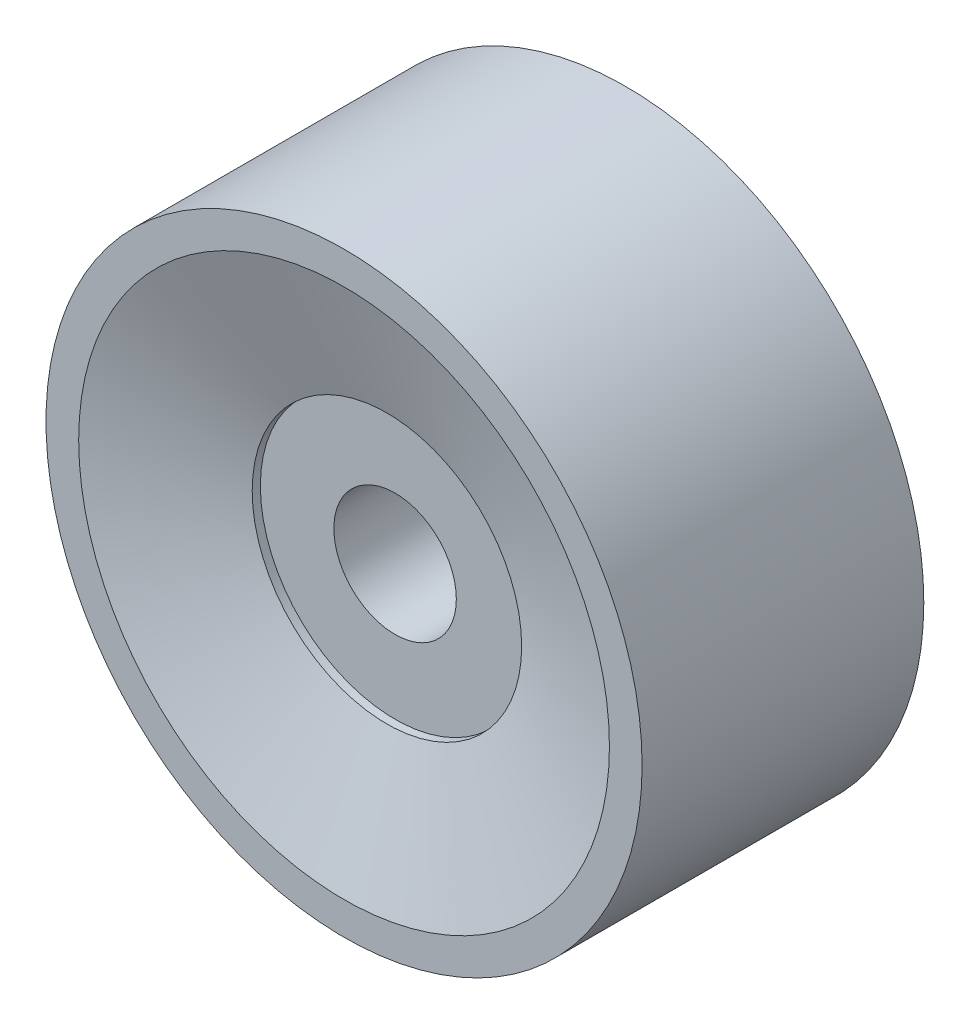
ISO-10303-21;
HEADER;
FILE_DESCRIPTION(('STEP AP214'),'2;1');
FILE_NAME('part.step','',(''),(''),'','','');
FILE_SCHEMA(('AUTOMOTIVE_DESIGN { 1 0 10303 214 1 1 1 1 }'));
ENDSEC;
DATA;
#1=APPLICATION_CONTEXT('core data for automotive mechanical design processes');
#2=APPLICATION_PROTOCOL_DEFINITION('international standard','automotive_design',2000,#1);
#3=PRODUCT_CONTEXT('',#1,'mechanical');
#4=PRODUCT('Part','Part','',(#3));
#5=PRODUCT_RELATED_PRODUCT_CATEGORY('part','',(#4));
#6=PRODUCT_DEFINITION_FORMATION('','',#4);
#7=PRODUCT_DEFINITION_CONTEXT('part definition',#1,'design');
#8=PRODUCT_DEFINITION('design','',#6,#7);
#9=PRODUCT_DEFINITION_SHAPE('','',#8);
#10=(LENGTH_UNIT() NAMED_UNIT(*) SI_UNIT(.MILLI.,.METRE.));
#11=(NAMED_UNIT(*) PLANE_ANGLE_UNIT() SI_UNIT($,.RADIAN.));
#12=(NAMED_UNIT(*) SI_UNIT($,.STERADIAN.) SOLID_ANGLE_UNIT());
#13=UNCERTAINTY_MEASURE_WITH_UNIT(LENGTH_MEASURE(1.E-05),#10,'distance_accuracy_value','');
#14=(GEOMETRIC_REPRESENTATION_CONTEXT(3) GLOBAL_UNCERTAINTY_ASSIGNED_CONTEXT((#13)) GLOBAL_UNIT_ASSIGNED_CONTEXT((#10,
#11,#12)) REPRESENTATION_CONTEXT('',''));
#15=CARTESIAN_POINT('',(0.,0.,0.));
#16=DIRECTION('',(0.,0.,1.));
#17=DIRECTION('',(1.,0.,0.));
#18=AXIS2_PLACEMENT_3D('',#15,#16,#17);
#19=CARTESIAN_POINT('',(0.,-42.5,17.25));
#20=DIRECTION('',(0.,0.,1.));
#21=DIRECTION('',(-1.,0.,0.));
#22=AXIS2_PLACEMENT_3D('',#19,#20,#21);
#23=PLANE('',#22);
#24=CARTESIAN_POINT('',(0.,0.,17.25));
#25=DIRECTION('',(0.,0.,-1.));
#26=DIRECTION('',(1.,0.,0.));
#27=AXIS2_PLACEMENT_3D('',#24,#25,#26);
#28=CIRCLE('',#27,32.5);
#29=CARTESIAN_POINT('',(32.5,0.,17.25));
#30=VERTEX_POINT('',#29);
#31=EDGE_CURVE('E32',#30,#30,#28,.T.);
#32=ORIENTED_EDGE('',*,*,#31,.T.);
#33=EDGE_LOOP('',(#32));
#34=FACE_BOUND('',#33,.T.);
#35=CARTESIAN_POINT('',(0.,0.,17.25));
#36=DIRECTION('',(0.,0.,1.));
#37=DIRECTION('',(1.,0.,0.));
#38=AXIS2_PLACEMENT_3D('',#35,#36,#37);
#39=CIRCLE('',#38,36.5);
#40=CARTESIAN_POINT('',(36.5,0.,17.25));
#41=VERTEX_POINT('',#40);
#42=EDGE_CURVE('E45',#41,#41,#39,.T.);
#43=ORIENTED_EDGE('',*,*,#42,.T.);
#44=EDGE_LOOP('',(#43));
#45=FACE_BOUND('',#44,.T.);
#46=ADVANCED_FACE('F12',(#34,#45),#23,.T.);
#47=CARTESIAN_POINT('',(0.,-42.5,-17.25));
#48=DIRECTION('',(0.,0.,1.));
#49=DIRECTION('',(-1.,0.,0.));
#50=AXIS2_PLACEMENT_3D('',#47,#48,#49);
#51=PLANE('',#50);
#52=CARTESIAN_POINT('',(0.,0.,-17.25));
#53=DIRECTION('',(0.,0.,-1.));
#54=DIRECTION('',(1.,0.,0.));
#55=AXIS2_PLACEMENT_3D('',#52,#53,#54);
#56=CIRCLE('',#55,32.5);
#57=CARTESIAN_POINT('',(32.5,0.,-17.25));
#58=VERTEX_POINT('',#57);
#59=EDGE_CURVE('E35',#58,#58,#56,.T.);
#60=ORIENTED_EDGE('',*,*,#59,.F.);
#61=EDGE_LOOP('',(#60));
#62=FACE_BOUND('',#61,.T.);
#63=CARTESIAN_POINT('',(0.,0.,-17.25));
#64=DIRECTION('',(0.,0.,1.));
#65=DIRECTION('',(1.,0.,0.));
#66=AXIS2_PLACEMENT_3D('',#63,#64,#65);
#67=CIRCLE('',#66,36.5);
#68=CARTESIAN_POINT('',(36.5,0.,-17.25));
#69=VERTEX_POINT('',#68);
#70=EDGE_CURVE('E44',#69,#69,#67,.T.);
#71=ORIENTED_EDGE('',*,*,#70,.F.);
#72=EDGE_LOOP('',(#71));
#73=FACE_BOUND('',#72,.T.);
#74=ADVANCED_FACE('F54',(#62,#73),#51,.F.);
#75=CARTESIAN_POINT('',(0.,-7.5,-11.));
#76=DIRECTION('',(0.,0.,-1.));
#77=DIRECTION('',(1.,0.,0.));
#78=AXIS2_PLACEMENT_3D('',#75,#76,#77);
#79=PLANE('',#78);
#80=CARTESIAN_POINT('',(0.,0.,-11.));
#81=DIRECTION('',(0.,0.,-1.));
#82=DIRECTION('',(1.,0.,0.));
#83=AXIS2_PLACEMENT_3D('',#80,#81,#82);
#84=CIRCLE('',#83,16.5);
#85=CARTESIAN_POINT('',(16.5,0.,-11.));
#86=VERTEX_POINT('',#85);
#87=EDGE_CURVE('E41',#86,#86,#84,.T.);
#88=ORIENTED_EDGE('',*,*,#87,.T.);
#89=EDGE_LOOP('',(#88));
#90=FACE_BOUND('',#89,.T.);
#91=CARTESIAN_POINT('',(0.,0.,-11.));
#92=DIRECTION('',(0.,0.,-1.));
#93=DIRECTION('',(1.,0.,0.));
#94=AXIS2_PLACEMENT_3D('',#91,#92,#93);
#95=CIRCLE('',#94,7.5);
#96=CARTESIAN_POINT('',(7.5,0.,-11.));
#97=VERTEX_POINT('',#96);
#98=EDGE_CURVE('E8',#97,#97,#95,.T.);
#99=ORIENTED_EDGE('',*,*,#98,.F.);
#100=EDGE_LOOP('',(#99));
#101=FACE_BOUND('',#100,.T.);
#102=ADVANCED_FACE('F14',(#90,#101),#79,.T.);
#103=CARTESIAN_POINT('',(0.,0.,-20.));
#104=DIRECTION('',(0.,0.,-1.));
#105=DIRECTION('',(1.,0.,0.));
#106=AXIS2_PLACEMENT_3D('',#103,#104,#105);
#107=CYLINDRICAL_SURFACE('',#106,7.5);
#108=ORIENTED_EDGE('',*,*,#98,.T.);
#109=EDGE_LOOP('',(#108));
#110=FACE_BOUND('',#109,.T.);
#111=CARTESIAN_POINT('',(0.,0.,11.));
#112=DIRECTION('',(0.,0.,-1.));
#113=DIRECTION('',(1.,0.,0.));
#114=AXIS2_PLACEMENT_3D('',#111,#112,#113);
#115=CIRCLE('',#114,7.5);
#116=CARTESIAN_POINT('',(7.5,0.,11.));
#117=VERTEX_POINT('',#116);
#118=EDGE_CURVE('E19',#117,#117,#115,.T.);
#119=ORIENTED_EDGE('',*,*,#118,.F.);
#120=EDGE_LOOP('',(#119));
#121=FACE_BOUND('',#120,.T.);
#122=ADVANCED_FACE('F64',(#110,#121),#107,.F.);
#123=CARTESIAN_POINT('',(0.,-7.5,11.));
#124=DIRECTION('',(0.,0.,-1.));
#125=DIRECTION('',(1.,0.,0.));
#126=AXIS2_PLACEMENT_3D('',#123,#124,#125);
#127=PLANE('',#126);
#128=CARTESIAN_POINT('',(0.,0.,11.));
#129=DIRECTION('',(0.,0.,-1.));
#130=DIRECTION('',(1.,0.,0.));
#131=AXIS2_PLACEMENT_3D('',#128,#129,#130);
#132=CIRCLE('',#131,16.5);
#133=CARTESIAN_POINT('',(16.5,0.,11.));
#134=VERTEX_POINT('',#133);
#135=EDGE_CURVE('E23',#134,#134,#132,.T.);
#136=ORIENTED_EDGE('',*,*,#135,.F.);
#137=EDGE_LOOP('',(#136));
#138=FACE_BOUND('',#137,.T.);
#139=ORIENTED_EDGE('',*,*,#118,.T.);
#140=EDGE_LOOP('',(#139));
#141=FACE_BOUND('',#140,.T.);
#142=ADVANCED_FACE('F80',(#138,#141),#127,.F.);
#143=CARTESIAN_POINT('',(0.,0.,-20.));
#144=DIRECTION('',(0.,0.,-1.));
#145=DIRECTION('',(1.,0.,0.));
#146=AXIS2_PLACEMENT_3D('',#143,#144,#145);
#147=CYLINDRICAL_SURFACE('',#146,16.5);
#148=CARTESIAN_POINT('',(0.,0.,12.));
#149=DIRECTION('',(0.,0.,-1.));
#150=DIRECTION('',(1.,0.,0.));
#151=AXIS2_PLACEMENT_3D('',#148,#149,#150);
#152=CIRCLE('',#151,16.5);
#153=CARTESIAN_POINT('',(16.5,0.,12.));
#154=VERTEX_POINT('',#153);
#155=EDGE_CURVE('E27',#154,#154,#152,.T.);
#156=ORIENTED_EDGE('',*,*,#155,.F.);
#157=EDGE_LOOP('',(#156));
#158=FACE_BOUND('',#157,.T.);
#159=ORIENTED_EDGE('',*,*,#135,.T.);
#160=EDGE_LOOP('',(#159));
#161=FACE_BOUND('',#160,.T.);
#162=ADVANCED_FACE('F76',(#158,#161),#147,.F.);
#163=CARTESIAN_POINT('',(0.,0.,12.));
#164=DIRECTION('',(0.,0.,1.));
#165=DIRECTION('',(-1.,0.,0.));
#166=AXIS2_PLACEMENT_3D('',#163,#164,#165);
#167=CONICAL_SURFACE('',#166,16.5,1.25374057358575);
#168=ORIENTED_EDGE('',*,*,#31,.F.);
#169=EDGE_LOOP('',(#168));
#170=FACE_BOUND('',#169,.T.);
#171=ORIENTED_EDGE('',*,*,#155,.T.);
#172=EDGE_LOOP('',(#171));
#173=FACE_BOUND('',#172,.T.);
#174=ADVANCED_FACE('F73',(#170,#173),#167,.F.);
#175=CARTESIAN_POINT('',(0.,0.,-12.));
#176=DIRECTION('',(0.,0.,-1.));
#177=DIRECTION('',(1.,0.,0.));
#178=AXIS2_PLACEMENT_3D('',#175,#176,#177);
#179=CONICAL_SURFACE('',#178,16.5,1.25374057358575);
#180=ORIENTED_EDGE('',*,*,#59,.T.);
#181=EDGE_LOOP('',(#180));
#182=FACE_BOUND('',#181,.T.);
#183=CARTESIAN_POINT('',(0.,0.,-12.));
#184=DIRECTION('',(0.,0.,-1.));
#185=DIRECTION('',(1.,0.,0.));
#186=AXIS2_PLACEMENT_3D('',#183,#184,#185);
#187=CIRCLE('',#186,16.5);
#188=CARTESIAN_POINT('',(16.5,0.,-12.));
#189=VERTEX_POINT('',#188);
#190=EDGE_CURVE('E38',#189,#189,#187,.T.);
#191=ORIENTED_EDGE('',*,*,#190,.F.);
#192=EDGE_LOOP('',(#191));
#193=FACE_BOUND('',#192,.T.);
#194=ADVANCED_FACE('F70',(#182,#193),#179,.F.);
#195=CARTESIAN_POINT('',(0.,0.,-20.));
#196=DIRECTION('',(0.,0.,-1.));
#197=DIRECTION('',(1.,0.,0.));
#198=AXIS2_PLACEMENT_3D('',#195,#196,#197);
#199=CYLINDRICAL_SURFACE('',#198,16.5);
#200=ORIENTED_EDGE('',*,*,#190,.T.);
#201=EDGE_LOOP('',(#200));
#202=FACE_BOUND('',#201,.T.);
#203=ORIENTED_EDGE('',*,*,#87,.F.);
#204=EDGE_LOOP('',(#203));
#205=FACE_BOUND('',#204,.T.);
#206=ADVANCED_FACE('F118',(#202,#205),#199,.F.);
#207=CARTESIAN_POINT('',(0.,0.,-17.25));
#208=DIRECTION('',(0.,0.,1.));
#209=DIRECTION('',(1.,0.,0.));
#210=AXIS2_PLACEMENT_3D('',#207,#208,#209);
#211=CYLINDRICAL_SURFACE('',#210,36.5);
#212=ORIENTED_EDGE('',*,*,#70,.T.);
#213=EDGE_LOOP('',(#212));
#214=FACE_BOUND('',#213,.T.);
#215=ORIENTED_EDGE('',*,*,#42,.F.);
#216=EDGE_LOOP('',(#215));
#217=FACE_BOUND('',#216,.T.);
#218=ADVANCED_FACE('F51',(#214,#217),#211,.T.);
#219=CLOSED_SHELL('',(#46,#74,#102,#122,#142,#162,#174,#194,#206,#218));
#220=MANIFOLD_SOLID_BREP('B1',#219);
#221=ADVANCED_BREP_SHAPE_REPRESENTATION('',(#18,#220),#14);
#222=SHAPE_DEFINITION_REPRESENTATION(#9,#221);
ENDSEC;
END-ISO-10303-21;
